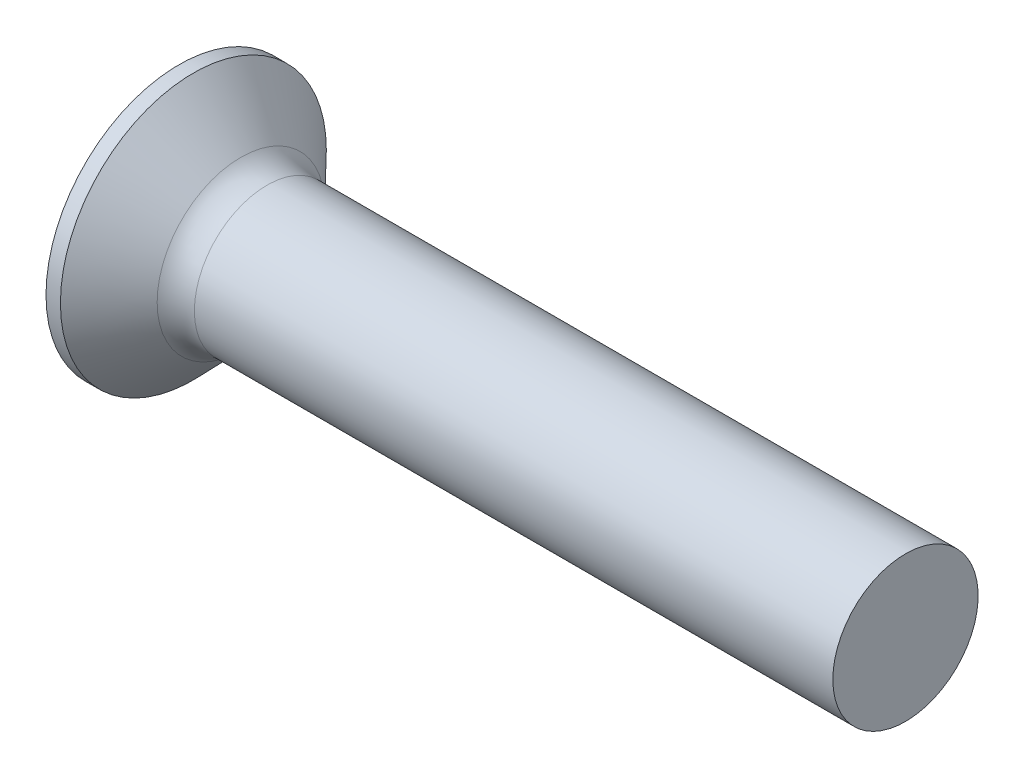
from build123d import *

# Parameters (mm, degrees)
FILLET1_R    = 2.5
RECPAT_COUNT = 2
RECPAT_ANGLE = 90


with BuildPart() as part:
    # BodySke → Base-Revolve (revolve)
    with BuildSketch(Plane.XY, mode=Mode.PRIVATE) as base_revolve_sk:
        with BuildLine():
            Line((0, 0), (52.3, 0))
            Line((52.3, 0), (52.3, 5))
            Line((52.3, 5), (7.3, 5))
            Line((7.3, 5), (3.292391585, 9.15))
            Line((3.292391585, 9.15), (2.3, 9.15))
            ThreePointArc((2.3, 9.15), (0.583806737, 4.717321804), (0, 0))
        make_face()
    revolve(base_revolve_sk.sketch.rotate(Axis((-15.875, 0, 0), (1, 0, 0)), 90), axis=Axis((-15.875, 0, 0), (1, 0, 0)))

    # Fillet1
    fillet1_edges = [part.edges().sort_by_distance(p)[0] for p in [
        (7.3, 0, -5),
    ]]
    fillet(fillet1_edges, radius=FILLET1_R)

    # Sketch3 → Recess section 0
    with BuildSketch(Plane(origin=(0, 0, 0), x_dir=(0, 0, -1), z_dir=(1, 0, 0))):
        with BuildLine():
            Line((1.08, -5.15), (-1.08, -5.15))
            Line((-1.08, -5.15), (-1.08, 5.15))
            Line((-1.08, 5.15), (1.08, 5.15))
            Line((1.08, 5.15), (1.08, -5.15))
        make_face()
    # Sketch4 → Recess section 1
    with BuildSketch(Plane(origin=(6.05, 0, 0), x_dir=(0, 0, -1), z_dir=(1, 0, 0))):
        with BuildLine():
            Line((1.08, -2.133581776), (-1.08, -2.133581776))
            Line((-1.08, -2.133581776), (-1.08, 2.133581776))
            Line((-1.08, 2.133581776), (1.08, 2.133581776))
            Line((1.08, 2.133581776), (1.08, -2.133581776))
        make_face()
    recess = loft(mode=Mode.SUBTRACT)

    # RecPat: Recess ×2 about axis
    recpat_axis = Axis((0, 0, 0), (1, 0, 0))
    for i in range(1, RECPAT_COUNT):
        add(recess.rotate(recpat_axis, i * RECPAT_ANGLE / (RECPAT_COUNT - 1)), mode=Mode.SUBTRACT)

    # RecCorSke → RecessCore (revolve, cut)
    with BuildSketch(Plane.XY, mode=Mode.PRIVATE) as recesscore_sk:
        Polygon((0, 0), (0, 2.353557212), (6.05, 1.9305), (6.677257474, 0), align=None)
    revolve(recesscore_sk.sketch.rotate(Axis((-3.175, 0, 0), (1, 0, 0)), 90), axis=Axis((-3.175, 0, 0), (1, 0, 0)), mode=Mode.SUBTRACT)


solid = part.part
